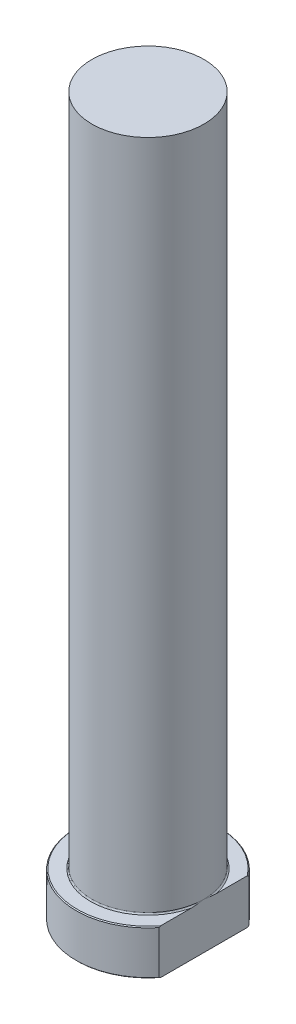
from build123d import *
from build123d.topology import SkipClean

# Parameters (mm, degrees)
CHAMFER1_SIZE = 0.2
FILLET1_R     = 0.3
KEY_DEPTH     = 162.592079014


with BuildPart() as part:
    # Sketch1 → Revolve1 (revolve)
    with BuildSketch(Plane.XY, mode=Mode.PRIVATE) as revolve1_sk:
        Polygon((0, 0), (-16, 0), (-16, 10), (-12.5, 10), (-12.5, 160), (0, 160), align=None)
    revolve(revolve1_sk.sketch.rotate(Axis((0, 259.958771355, 0), (0, -1, 0)), 270), axis=Axis((0, 259.958771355, 0), (0, -1, 0)))

    # Chamfer1
    chamfer1_edges = [part.edges().sort_by_distance(p)[0] for p in [
        (0, 10, -16),
        (0, 0, -16),
    ]]
    chamfer(chamfer1_edges, length=CHAMFER1_SIZE)

    # Fillet1
    fillet1_edges = [part.edges().sort_by_distance(p)[0] for p in [
        (0, 10, -12.5),
    ]]
    fillet(fillet1_edges, radius=FILLET1_R)

    # Sketch2 → KEY (cut, through all)
    with SkipClean():  # the faces are left unmerged after this step: merging them gives an invalid solid
        with BuildSketch(Plane(origin=(0, 0, 0), x_dir=(1, 0, 0), z_dir=(0, 1, 0))):
            with BuildLine():
                Line((12.5, 9.987492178), (12.5, -9.987492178))
                ThreePointArc((12.5, -9.987492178), (16, 0), (12.5, 9.987492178))
            make_face()
        extrude(amount=KEY_DEPTH, mode=Mode.SUBTRACT)


solid = part.part
